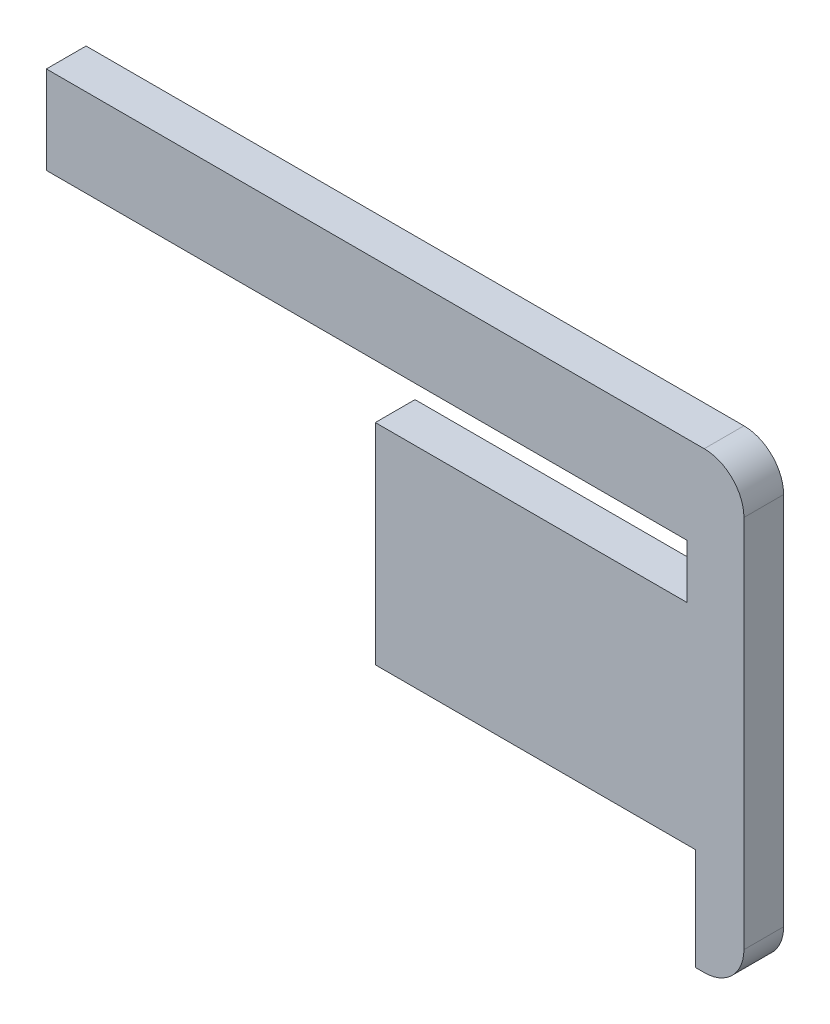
ISO-10303-21;
HEADER;
FILE_DESCRIPTION(('STEP AP214'),'2;1');
FILE_NAME('part.step','',(''),(''),'','','');
FILE_SCHEMA(('AUTOMOTIVE_DESIGN { 1 0 10303 214 1 1 1 1 }'));
ENDSEC;
DATA;
#1=APPLICATION_CONTEXT('core data for automotive mechanical design processes');
#2=APPLICATION_PROTOCOL_DEFINITION('international standard','automotive_design',2000,#1);
#3=PRODUCT_CONTEXT('',#1,'mechanical');
#4=PRODUCT('Part','Part','',(#3));
#5=PRODUCT_RELATED_PRODUCT_CATEGORY('part','',(#4));
#6=PRODUCT_DEFINITION_FORMATION('','',#4);
#7=PRODUCT_DEFINITION_CONTEXT('part definition',#1,'design');
#8=PRODUCT_DEFINITION('design','',#6,#7);
#9=PRODUCT_DEFINITION_SHAPE('','',#8);
#10=(LENGTH_UNIT() NAMED_UNIT(*) SI_UNIT(.MILLI.,.METRE.));
#11=(NAMED_UNIT(*) PLANE_ANGLE_UNIT() SI_UNIT($,.RADIAN.));
#12=(NAMED_UNIT(*) SI_UNIT($,.STERADIAN.) SOLID_ANGLE_UNIT());
#13=UNCERTAINTY_MEASURE_WITH_UNIT(LENGTH_MEASURE(1.E-05),#10,'distance_accuracy_value','');
#14=(GEOMETRIC_REPRESENTATION_CONTEXT(3) GLOBAL_UNCERTAINTY_ASSIGNED_CONTEXT((#13)) GLOBAL_UNIT_ASSIGNED_CONTEXT((#10,
#11,#12)) REPRESENTATION_CONTEXT('',''));
#15=CARTESIAN_POINT('',(0.,0.,0.));
#16=DIRECTION('',(0.,0.,1.));
#17=DIRECTION('',(1.,0.,0.));
#18=AXIS2_PLACEMENT_3D('',#15,#16,#17);
#19=CARTESIAN_POINT('',(0.,0.,1.4));
#20=DIRECTION('',(0.,0.,1.));
#21=DIRECTION('',(1.,0.,0.));
#22=AXIS2_PLACEMENT_3D('',#19,#20,#21);
#23=PLANE('',#22);
#24=DIRECTION('',(-1.,0.,0.));
#25=VECTOR('',#24,1.);
#26=CARTESIAN_POINT('',(-10.,3.6,1.4));
#27=LINE('',#26,#25);
#28=CARTESIAN_POINT('',(-1.7000000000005,3.6,1.4));
#29=VERTEX_POINT('',#28);
#30=CARTESIAN_POINT('',(-13.,3.6,1.4));
#31=VERTEX_POINT('',#30);
#32=EDGE_CURVE('E165',#29,#31,#27,.T.);
#33=ORIENTED_EDGE('',*,*,#32,.F.);
#34=DIRECTION('',(0.,1.,0.));
#35=VECTOR('',#34,1.);
#36=CARTESIAN_POINT('',(-1.7000000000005,3.6,1.4));
#37=LINE('',#36,#35);
#38=CARTESIAN_POINT('',(-1.7000000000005,0.,1.4));
#39=VERTEX_POINT('',#38);
#40=EDGE_CURVE('E163',#39,#29,#37,.T.);
#41=ORIENTED_EDGE('',*,*,#40,.F.);
#42=DIRECTION('',(1.,0.,0.));
#43=VECTOR('',#42,1.);
#44=CARTESIAN_POINT('',(-10.,0.,1.4));
#45=LINE('',#44,#43);
#46=CARTESIAN_POINT('',(-1.4,0.,1.4));
#47=VERTEX_POINT('',#46);
#48=EDGE_CURVE('E187',#39,#47,#45,.T.);
#49=ORIENTED_EDGE('',*,*,#48,.T.);
#50=CARTESIAN_POINT('',(-1.4,1.4,1.4));
#51=DIRECTION('',(0.,0.,1.));
#52=DIRECTION('',(1.,0.,0.));
#53=AXIS2_PLACEMENT_3D('',#50,#51,#52);
#54=CIRCLE('',#53,1.4);
#55=CARTESIAN_POINT('',(0.,1.4,1.4));
#56=VERTEX_POINT('',#55);
#57=EDGE_CURVE('E41',#47,#56,#54,.T.);
#58=ORIENTED_EDGE('',*,*,#57,.T.);
#59=DIRECTION('',(0.,1.,0.));
#60=VECTOR('',#59,1.);
#61=CARTESIAN_POINT('',(0.,16.,1.4));
#62=LINE('',#61,#60);
#63=CARTESIAN_POINT('',(0.,14.6,1.4));
#64=VERTEX_POINT('',#63);
#65=EDGE_CURVE('E189',#56,#64,#62,.T.);
#66=ORIENTED_EDGE('',*,*,#65,.T.);
#67=CARTESIAN_POINT('',(-1.4,14.6,1.4));
#68=DIRECTION('',(0.,0.,1.));
#69=DIRECTION('',(1.,0.,0.));
#70=AXIS2_PLACEMENT_3D('',#67,#68,#69);
#71=CIRCLE('',#70,1.4);
#72=CARTESIAN_POINT('',(-1.4,16.,1.4));
#73=VERTEX_POINT('',#72);
#74=EDGE_CURVE('E56',#64,#73,#71,.T.);
#75=ORIENTED_EDGE('',*,*,#74,.T.);
#76=DIRECTION('',(-1.,0.,0.));
#77=VECTOR('',#76,1.);
#78=CARTESIAN_POINT('',(-10.,16.,1.4));
#79=LINE('',#78,#77);
#80=CARTESIAN_POINT('',(-24.6,16.,1.4));
#81=VERTEX_POINT('',#80);
#82=EDGE_CURVE('E192',#73,#81,#79,.T.);
#83=ORIENTED_EDGE('',*,*,#82,.T.);
#84=DIRECTION('',(0.,-1.,0.));
#85=VECTOR('',#84,1.);
#86=CARTESIAN_POINT('',(-24.6,12.9,1.4));
#87=LINE('',#86,#85);
#88=CARTESIAN_POINT('',(-24.6,12.9,1.4));
#89=VERTEX_POINT('',#88);
#90=EDGE_CURVE('E152',#81,#89,#87,.T.);
#91=ORIENTED_EDGE('',*,*,#90,.T.);
#92=DIRECTION('',(-1.,0.,0.));
#93=VECTOR('',#92,1.);
#94=CARTESIAN_POINT('',(-10.,12.9,1.4));
#95=LINE('',#94,#93);
#96=CARTESIAN_POINT('',(-2.,12.9,1.4));
#97=VERTEX_POINT('',#96);
#98=EDGE_CURVE('E175',#97,#89,#95,.T.);
#99=ORIENTED_EDGE('',*,*,#98,.F.);
#100=DIRECTION('',(0.,1.,0.));
#101=VECTOR('',#100,1.);
#102=CARTESIAN_POINT('',(-2.,12.9,1.4));
#103=LINE('',#102,#101);
#104=CARTESIAN_POINT('',(-2.,11.,1.4));
#105=VERTEX_POINT('',#104);
#106=EDGE_CURVE('E129',#105,#97,#103,.T.);
#107=ORIENTED_EDGE('',*,*,#106,.F.);
#108=DIRECTION('',(1.,0.,0.));
#109=VECTOR('',#108,1.);
#110=CARTESIAN_POINT('',(-10.,11.,1.4));
#111=LINE('',#110,#109);
#112=CARTESIAN_POINT('',(-13.,11.,1.4));
#113=VERTEX_POINT('',#112);
#114=EDGE_CURVE('E122',#113,#105,#111,.T.);
#115=ORIENTED_EDGE('',*,*,#114,.F.);
#116=DIRECTION('',(0.,-1.,0.));
#117=VECTOR('',#116,1.);
#118=CARTESIAN_POINT('',(-13.,11.,1.4));
#119=LINE('',#118,#117);
#120=EDGE_CURVE('E126',#113,#31,#119,.T.);
#121=ORIENTED_EDGE('',*,*,#120,.T.);
#122=EDGE_LOOP('',(#33,#41,#49,#58,#66,#75,#83,#91,#99,#107,#115,#121));
#123=FACE_BOUND('',#122,.T.);
#124=ADVANCED_FACE('F33',(#123),#23,.T.);
#125=CARTESIAN_POINT('',(0.,0.,0.));
#126=DIRECTION('',(0.,0.,1.));
#127=DIRECTION('',(1.,0.,0.));
#128=AXIS2_PLACEMENT_3D('',#125,#126,#127);
#129=PLANE('',#128);
#130=DIRECTION('',(0.,1.,0.));
#131=VECTOR('',#130,1.);
#132=CARTESIAN_POINT('',(-1.7000000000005,3.6,0.));
#133=LINE('',#132,#131);
#134=CARTESIAN_POINT('',(-1.7000000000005,0.,0.));
#135=VERTEX_POINT('',#134);
#136=CARTESIAN_POINT('',(-1.7000000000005,3.6,0.));
#137=VERTEX_POINT('',#136);
#138=EDGE_CURVE('E48',#135,#137,#133,.T.);
#139=ORIENTED_EDGE('',*,*,#138,.T.);
#140=DIRECTION('',(-1.,0.,0.));
#141=VECTOR('',#140,1.);
#142=CARTESIAN_POINT('',(-10.,3.6,0.));
#143=LINE('',#142,#141);
#144=CARTESIAN_POINT('',(-13.,3.6,0.));
#145=VERTEX_POINT('',#144);
#146=EDGE_CURVE('E166',#137,#145,#143,.T.);
#147=ORIENTED_EDGE('',*,*,#146,.T.);
#148=DIRECTION('',(0.,-1.,0.));
#149=VECTOR('',#148,1.);
#150=CARTESIAN_POINT('',(-13.,11.,0.));
#151=LINE('',#150,#149);
#152=CARTESIAN_POINT('',(-13.,11.,0.));
#153=VERTEX_POINT('',#152);
#154=EDGE_CURVE('E147',#153,#145,#151,.T.);
#155=ORIENTED_EDGE('',*,*,#154,.F.);
#156=DIRECTION('',(1.,0.,0.));
#157=VECTOR('',#156,1.);
#158=CARTESIAN_POINT('',(-10.,11.,0.));
#159=LINE('',#158,#157);
#160=CARTESIAN_POINT('',(-2.,11.,0.));
#161=VERTEX_POINT('',#160);
#162=EDGE_CURVE('E138',#153,#161,#159,.T.);
#163=ORIENTED_EDGE('',*,*,#162,.T.);
#164=DIRECTION('',(0.,1.,0.));
#165=VECTOR('',#164,1.);
#166=CARTESIAN_POINT('',(-2.,12.9,0.));
#167=LINE('',#166,#165);
#168=CARTESIAN_POINT('',(-2.,12.9,0.));
#169=VERTEX_POINT('',#168);
#170=EDGE_CURVE('E179',#161,#169,#167,.T.);
#171=ORIENTED_EDGE('',*,*,#170,.T.);
#172=DIRECTION('',(-1.,0.,0.));
#173=VECTOR('',#172,1.);
#174=CARTESIAN_POINT('',(-10.,12.9,0.));
#175=LINE('',#174,#173);
#176=CARTESIAN_POINT('',(-24.6,12.9,0.));
#177=VERTEX_POINT('',#176);
#178=EDGE_CURVE('E132',#169,#177,#175,.T.);
#179=ORIENTED_EDGE('',*,*,#178,.T.);
#180=DIRECTION('',(0.,-1.,0.));
#181=VECTOR('',#180,1.);
#182=CARTESIAN_POINT('',(-24.6,12.9,0.));
#183=LINE('',#182,#181);
#184=CARTESIAN_POINT('',(-24.6,16.,0.));
#185=VERTEX_POINT('',#184);
#186=EDGE_CURVE('E142',#185,#177,#183,.T.);
#187=ORIENTED_EDGE('',*,*,#186,.F.);
#188=DIRECTION('',(-1.,0.,0.));
#189=VECTOR('',#188,1.);
#190=CARTESIAN_POINT('',(-10.,16.,0.));
#191=LINE('',#190,#189);
#192=CARTESIAN_POINT('',(-1.4,16.,0.));
#193=VERTEX_POINT('',#192);
#194=EDGE_CURVE('E190',#193,#185,#191,.T.);
#195=ORIENTED_EDGE('',*,*,#194,.F.);
#196=CARTESIAN_POINT('',(-1.4,14.6,0.));
#197=DIRECTION('',(0.,0.,1.));
#198=DIRECTION('',(1.,0.,0.));
#199=AXIS2_PLACEMENT_3D('',#196,#197,#198);
#200=CIRCLE('',#199,1.4);
#201=CARTESIAN_POINT('',(0.,14.6,0.));
#202=VERTEX_POINT('',#201);
#203=EDGE_CURVE('E204',#193,#202,#200,.F.);
#204=ORIENTED_EDGE('',*,*,#203,.T.);
#205=DIRECTION('',(0.,1.,0.));
#206=VECTOR('',#205,1.);
#207=CARTESIAN_POINT('',(0.,16.,0.));
#208=LINE('',#207,#206);
#209=CARTESIAN_POINT('',(0.,1.4,0.));
#210=VERTEX_POINT('',#209);
#211=EDGE_CURVE('E196',#210,#202,#208,.T.);
#212=ORIENTED_EDGE('',*,*,#211,.F.);
#213=CARTESIAN_POINT('',(-1.4,1.4,0.));
#214=DIRECTION('',(0.,0.,1.));
#215=DIRECTION('',(1.,0.,0.));
#216=AXIS2_PLACEMENT_3D('',#213,#214,#215);
#217=CIRCLE('',#216,1.4);
#218=CARTESIAN_POINT('',(-1.4,0.,0.));
#219=VERTEX_POINT('',#218);
#220=EDGE_CURVE('E206',#210,#219,#217,.F.);
#221=ORIENTED_EDGE('',*,*,#220,.T.);
#222=DIRECTION('',(1.,0.,0.));
#223=VECTOR('',#222,1.);
#224=CARTESIAN_POINT('',(-10.,0.,0.));
#225=LINE('',#224,#223);
#226=EDGE_CURVE('E186',#135,#219,#225,.T.);
#227=ORIENTED_EDGE('',*,*,#226,.F.);
#228=EDGE_LOOP('',(#139,#147,#155,#163,#171,#179,#187,#195,#204,#212,#221,#227));
#229=FACE_BOUND('',#228,.T.);
#230=ADVANCED_FACE('F226',(#229),#129,.F.);
#231=CARTESIAN_POINT('',(-10.,0.,1.4));
#232=DIRECTION('',(0.,1.,0.));
#233=DIRECTION('',(0.,0.,1.));
#234=AXIS2_PLACEMENT_3D('',#231,#232,#233);
#235=PLANE('',#234);
#236=DIRECTION('',(0.,0.,-1.));
#237=VECTOR('',#236,1.);
#238=CARTESIAN_POINT('',(-1.7000000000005,0.,1.4));
#239=LINE('',#238,#237);
#240=EDGE_CURVE('E172',#39,#135,#239,.T.);
#241=ORIENTED_EDGE('',*,*,#240,.T.);
#242=ORIENTED_EDGE('',*,*,#226,.T.);
#243=DIRECTION('',(0.,0.,-1.));
#244=VECTOR('',#243,1.);
#245=CARTESIAN_POINT('',(-1.4,0.,1.4));
#246=LINE('',#245,#244);
#247=EDGE_CURVE('E209',#219,#47,#246,.F.);
#248=ORIENTED_EDGE('',*,*,#247,.T.);
#249=ORIENTED_EDGE('',*,*,#48,.F.);
#250=EDGE_LOOP('',(#241,#242,#248,#249));
#251=FACE_BOUND('',#250,.T.);
#252=ADVANCED_FACE('F250',(#251),#235,.F.);
#253=CARTESIAN_POINT('',(0.,16.,1.4));
#254=DIRECTION('',(-1.,0.,0.));
#255=DIRECTION('',(0.,-1.,0.));
#256=AXIS2_PLACEMENT_3D('',#253,#254,#255);
#257=PLANE('',#256);
#258=ORIENTED_EDGE('',*,*,#65,.F.);
#259=DIRECTION('',(0.,0.,-1.));
#260=VECTOR('',#259,1.);
#261=CARTESIAN_POINT('',(0.,1.4,1.4));
#262=LINE('',#261,#260);
#263=EDGE_CURVE('E201',#56,#210,#262,.T.);
#264=ORIENTED_EDGE('',*,*,#263,.T.);
#265=ORIENTED_EDGE('',*,*,#211,.T.);
#266=DIRECTION('',(0.,0.,-1.));
#267=VECTOR('',#266,1.);
#268=CARTESIAN_POINT('',(0.,14.6,1.4));
#269=LINE('',#268,#267);
#270=EDGE_CURVE('E194',#202,#64,#269,.F.);
#271=ORIENTED_EDGE('',*,*,#270,.T.);
#272=EDGE_LOOP('',(#258,#264,#265,#271));
#273=FACE_BOUND('',#272,.T.);
#274=ADVANCED_FACE('F220',(#273),#257,.F.);
#275=CARTESIAN_POINT('',(-10.,16.,1.4));
#276=DIRECTION('',(0.,-1.,0.));
#277=DIRECTION('',(0.,0.,-1.));
#278=AXIS2_PLACEMENT_3D('',#275,#276,#277);
#279=PLANE('',#278);
#280=ORIENTED_EDGE('',*,*,#82,.F.);
#281=DIRECTION('',(0.,0.,-1.));
#282=VECTOR('',#281,1.);
#283=CARTESIAN_POINT('',(-1.4,16.,1.4));
#284=LINE('',#283,#282);
#285=EDGE_CURVE('E11',#73,#193,#284,.T.);
#286=ORIENTED_EDGE('',*,*,#285,.T.);
#287=ORIENTED_EDGE('',*,*,#194,.T.);
#288=DIRECTION('',(0.,0.,-1.));
#289=VECTOR('',#288,1.);
#290=CARTESIAN_POINT('',(-24.6,16.,1.4));
#291=LINE('',#290,#289);
#292=EDGE_CURVE('E160',#81,#185,#291,.T.);
#293=ORIENTED_EDGE('',*,*,#292,.F.);
#294=EDGE_LOOP('',(#280,#286,#287,#293));
#295=FACE_BOUND('',#294,.T.);
#296=ADVANCED_FACE('F231',(#295),#279,.F.);
#297=CARTESIAN_POINT('',(-1.4,1.4,1.4));
#298=DIRECTION('',(0.,0.,-1.));
#299=DIRECTION('',(-1.,0.,0.));
#300=AXIS2_PLACEMENT_3D('',#297,#298,#299);
#301=CYLINDRICAL_SURFACE('',#300,1.4);
#302=ORIENTED_EDGE('',*,*,#57,.F.);
#303=ORIENTED_EDGE('',*,*,#247,.F.);
#304=ORIENTED_EDGE('',*,*,#220,.F.);
#305=ORIENTED_EDGE('',*,*,#263,.F.);
#306=EDGE_LOOP('',(#302,#303,#304,#305));
#307=FACE_BOUND('',#306,.T.);
#308=ADVANCED_FACE('F223',(#307),#301,.T.);
#309=CARTESIAN_POINT('',(-1.4,14.6,1.4));
#310=DIRECTION('',(0.,0.,-1.));
#311=DIRECTION('',(-1.,0.,0.));
#312=AXIS2_PLACEMENT_3D('',#309,#310,#311);
#313=CYLINDRICAL_SURFACE('',#312,1.4);
#314=ORIENTED_EDGE('',*,*,#74,.F.);
#315=ORIENTED_EDGE('',*,*,#270,.F.);
#316=ORIENTED_EDGE('',*,*,#203,.F.);
#317=ORIENTED_EDGE('',*,*,#285,.F.);
#318=EDGE_LOOP('',(#314,#315,#316,#317));
#319=FACE_BOUND('',#318,.T.);
#320=ADVANCED_FACE('F35',(#319),#313,.T.);
#321=CARTESIAN_POINT('',(-10.,11.,1.4));
#322=DIRECTION('',(0.,1.,0.));
#323=DIRECTION('',(0.,0.,1.));
#324=AXIS2_PLACEMENT_3D('',#321,#322,#323);
#325=PLANE('',#324);
#326=ORIENTED_EDGE('',*,*,#162,.F.);
#327=DIRECTION('',(0.,0.,-1.));
#328=VECTOR('',#327,1.);
#329=CARTESIAN_POINT('',(-13.,11.,1.4));
#330=LINE('',#329,#328);
#331=EDGE_CURVE('E135',#113,#153,#330,.T.);
#332=ORIENTED_EDGE('',*,*,#331,.F.);
#333=ORIENTED_EDGE('',*,*,#114,.T.);
#334=DIRECTION('',(0.,0.,-1.));
#335=VECTOR('',#334,1.);
#336=CARTESIAN_POINT('',(-2.,11.,1.4));
#337=LINE('',#336,#335);
#338=EDGE_CURVE('E184',#105,#161,#337,.T.);
#339=ORIENTED_EDGE('',*,*,#338,.T.);
#340=EDGE_LOOP('',(#326,#332,#333,#339));
#341=FACE_BOUND('',#340,.T.);
#342=ADVANCED_FACE('F136',(#341),#325,.T.);
#343=CARTESIAN_POINT('',(-2.,12.9,1.4));
#344=DIRECTION('',(-1.,0.,0.));
#345=DIRECTION('',(0.,-1.,0.));
#346=AXIS2_PLACEMENT_3D('',#343,#344,#345);
#347=PLANE('',#346);
#348=ORIENTED_EDGE('',*,*,#170,.F.);
#349=ORIENTED_EDGE('',*,*,#338,.F.);
#350=ORIENTED_EDGE('',*,*,#106,.T.);
#351=DIRECTION('',(0.,0.,-1.));
#352=VECTOR('',#351,1.);
#353=CARTESIAN_POINT('',(-2.,12.9,1.4));
#354=LINE('',#353,#352);
#355=EDGE_CURVE('E177',#97,#169,#354,.T.);
#356=ORIENTED_EDGE('',*,*,#355,.T.);
#357=EDGE_LOOP('',(#348,#349,#350,#356));
#358=FACE_BOUND('',#357,.T.);
#359=ADVANCED_FACE('F244',(#358),#347,.T.);
#360=CARTESIAN_POINT('',(-10.,12.9,1.4));
#361=DIRECTION('',(0.,-1.,0.));
#362=DIRECTION('',(0.,0.,-1.));
#363=AXIS2_PLACEMENT_3D('',#360,#361,#362);
#364=PLANE('',#363);
#365=ORIENTED_EDGE('',*,*,#178,.F.);
#366=ORIENTED_EDGE('',*,*,#355,.F.);
#367=ORIENTED_EDGE('',*,*,#98,.T.);
#368=DIRECTION('',(0.,0.,-1.));
#369=VECTOR('',#368,1.);
#370=CARTESIAN_POINT('',(-24.6,12.9,1.4));
#371=LINE('',#370,#369);
#372=EDGE_CURVE('E155',#89,#177,#371,.T.);
#373=ORIENTED_EDGE('',*,*,#372,.T.);
#374=EDGE_LOOP('',(#365,#366,#367,#373));
#375=FACE_BOUND('',#374,.T.);
#376=ADVANCED_FACE('F240',(#375),#364,.T.);
#377=CARTESIAN_POINT('',(-1.7000000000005,3.6,1.4));
#378=DIRECTION('',(-1.,0.,0.));
#379=DIRECTION('',(0.,-1.,0.));
#380=AXIS2_PLACEMENT_3D('',#377,#378,#379);
#381=PLANE('',#380);
#382=ORIENTED_EDGE('',*,*,#138,.F.);
#383=ORIENTED_EDGE('',*,*,#240,.F.);
#384=ORIENTED_EDGE('',*,*,#40,.T.);
#385=DIRECTION('',(0.,0.,-1.));
#386=VECTOR('',#385,1.);
#387=CARTESIAN_POINT('',(-1.7000000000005,3.6,1.4));
#388=LINE('',#387,#386);
#389=EDGE_CURVE('E168',#29,#137,#388,.T.);
#390=ORIENTED_EDGE('',*,*,#389,.T.);
#391=EDGE_LOOP('',(#382,#383,#384,#390));
#392=FACE_BOUND('',#391,.T.);
#393=ADVANCED_FACE('F251',(#392),#381,.T.);
#394=CARTESIAN_POINT('',(-10.,3.6,1.4));
#395=DIRECTION('',(0.,-1.,0.));
#396=DIRECTION('',(0.,0.,-1.));
#397=AXIS2_PLACEMENT_3D('',#394,#395,#396);
#398=PLANE('',#397);
#399=ORIENTED_EDGE('',*,*,#146,.F.);
#400=ORIENTED_EDGE('',*,*,#389,.F.);
#401=ORIENTED_EDGE('',*,*,#32,.T.);
#402=DIRECTION('',(0.,0.,-1.));
#403=VECTOR('',#402,1.);
#404=CARTESIAN_POINT('',(-13.,3.6,1.4));
#405=LINE('',#404,#403);
#406=EDGE_CURVE('E143',#31,#145,#405,.T.);
#407=ORIENTED_EDGE('',*,*,#406,.T.);
#408=EDGE_LOOP('',(#399,#400,#401,#407));
#409=FACE_BOUND('',#408,.T.);
#410=ADVANCED_FACE('F247',(#409),#398,.T.);
#411=CARTESIAN_POINT('',(-24.6,12.9,1.4));
#412=DIRECTION('',(1.,0.,0.));
#413=DIRECTION('',(0.,0.,-1.));
#414=AXIS2_PLACEMENT_3D('',#411,#412,#413);
#415=PLANE('',#414);
#416=ORIENTED_EDGE('',*,*,#186,.T.);
#417=ORIENTED_EDGE('',*,*,#372,.F.);
#418=ORIENTED_EDGE('',*,*,#90,.F.);
#419=ORIENTED_EDGE('',*,*,#292,.T.);
#420=EDGE_LOOP('',(#416,#417,#418,#419));
#421=FACE_BOUND('',#420,.T.);
#422=ADVANCED_FACE('F237',(#421),#415,.F.);
#423=CARTESIAN_POINT('',(-13.,11.,1.4));
#424=DIRECTION('',(1.,0.,0.));
#425=DIRECTION('',(0.,1.,0.));
#426=AXIS2_PLACEMENT_3D('',#423,#424,#425);
#427=PLANE('',#426);
#428=ORIENTED_EDGE('',*,*,#154,.T.);
#429=ORIENTED_EDGE('',*,*,#406,.F.);
#430=ORIENTED_EDGE('',*,*,#120,.F.);
#431=ORIENTED_EDGE('',*,*,#331,.T.);
#432=EDGE_LOOP('',(#428,#429,#430,#431));
#433=FACE_BOUND('',#432,.T.);
#434=ADVANCED_FACE('F145',(#433),#427,.F.);
#435=CLOSED_SHELL('',(#124,#230,#252,#274,#296,#308,#320,#342,#359,#376,#393,#410,#422,#434));
#436=MANIFOLD_SOLID_BREP('B2',#435);
#437=ADVANCED_BREP_SHAPE_REPRESENTATION('',(#18,#436),#14);
#438=SHAPE_DEFINITION_REPRESENTATION(#9,#437);
ENDSEC;
END-ISO-10303-21;
